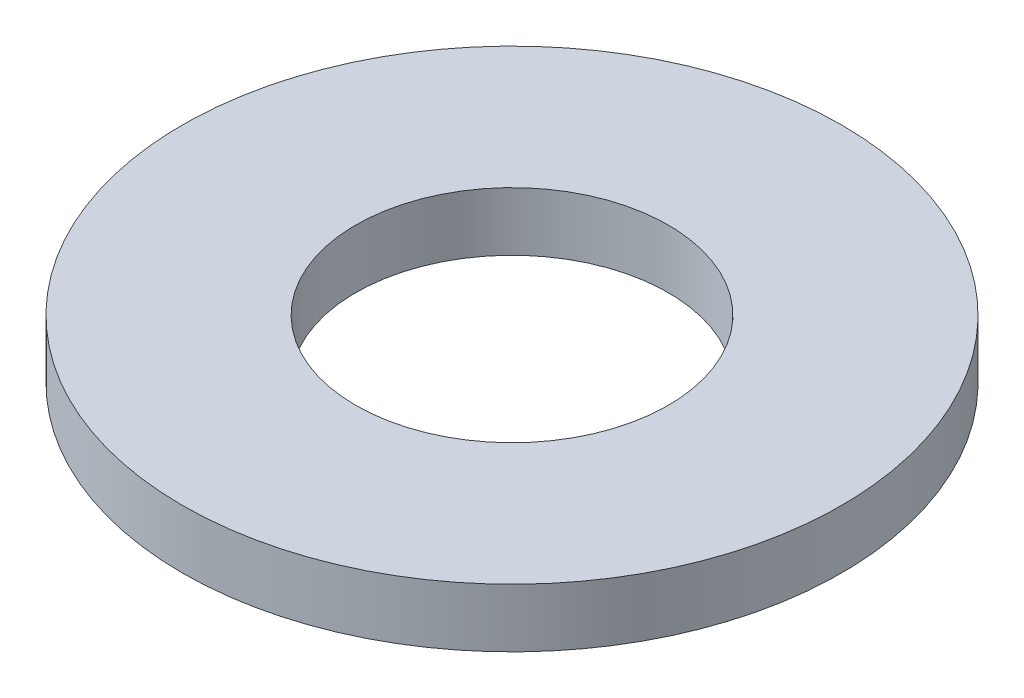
from build123d import *

# Parameters (mm, degrees)
SKETCH3_R           = 42.8625
BOSS_EXTRUDE1_DEPTH = 7.62
SKETCH2_R           = 20.32
CUT_EXTRUDE1_DEPTH  = 101.6


with BuildPart() as part:
    # Sketch3 → Boss-Extrude1 (new body)
    with BuildSketch(Plane(origin=(0, 0, 0), x_dir=(1, 0, 0), z_dir=(0, 1, 0))):
        with Locations(Location((0, 0, 0), (0, 0, 90))):
            Circle(SKETCH3_R)
    extrude(amount=BOSS_EXTRUDE1_DEPTH)

    # Sketch2 → Cut-Extrude1 (cut)
    with BuildSketch(Plane(origin=(0, 0, 0), x_dir=(1, 0, 0), z_dir=(0, 1, 0))):
        with Locations(Location((0, 0, 0), (0, 0, 270))):
            Circle(SKETCH2_R)
    extrude(amount=CUT_EXTRUDE1_DEPTH, mode=Mode.SUBTRACT)


solid = part.part
